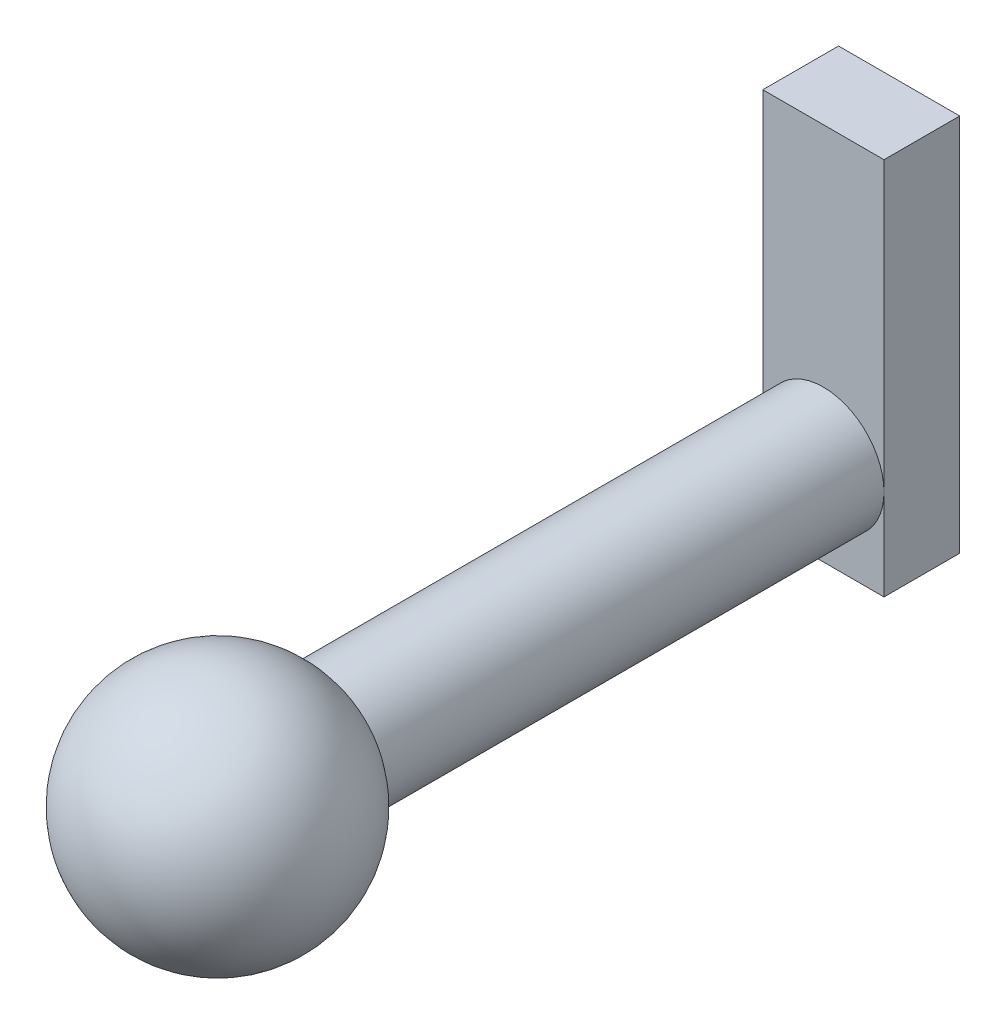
from build123d import *

# Parameters (mm, degrees)
ESQUISSE1_R        = 8
BOSS_EXTRU_1_DEPTH = 80
ESQUISSE2_W        = 16
ESQUISSE2_H        = 50
BOSS_EXTRU_2_DEPTH = 10


with BuildPart() as part:
    # Esquisse1 → Boss.-Extru.1 (new body)
    with BuildSketch(Plane.XY):
        Circle(ESQUISSE1_R)
    extrude(amount=BOSS_EXTRU_1_DEPTH)

    # Esquisse2 → Boss.-Extru.2 (add)
    with BuildSketch(Plane(origin=(0, 0, 0), x_dir=(-1, 0, 0), z_dir=(0, 0, -1))):
        with Locations((0, 13)):
            Rectangle(ESQUISSE2_W, ESQUISSE2_H)
    extrude(amount=BOSS_EXTRU_2_DEPTH)

    # Esquisse4 → R_volution1 (revolve)
    with BuildSketch(Plane.XY.offset(80)):
        with BuildLine():
            Line((0, 16), (0, -16))
            ThreePointArc((0, -16), (16, 0), (0, 16))
        make_face()
    revolve(axis=Axis((0, 19.824994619, 80), (0, -1, 0)))


solid = part.part
